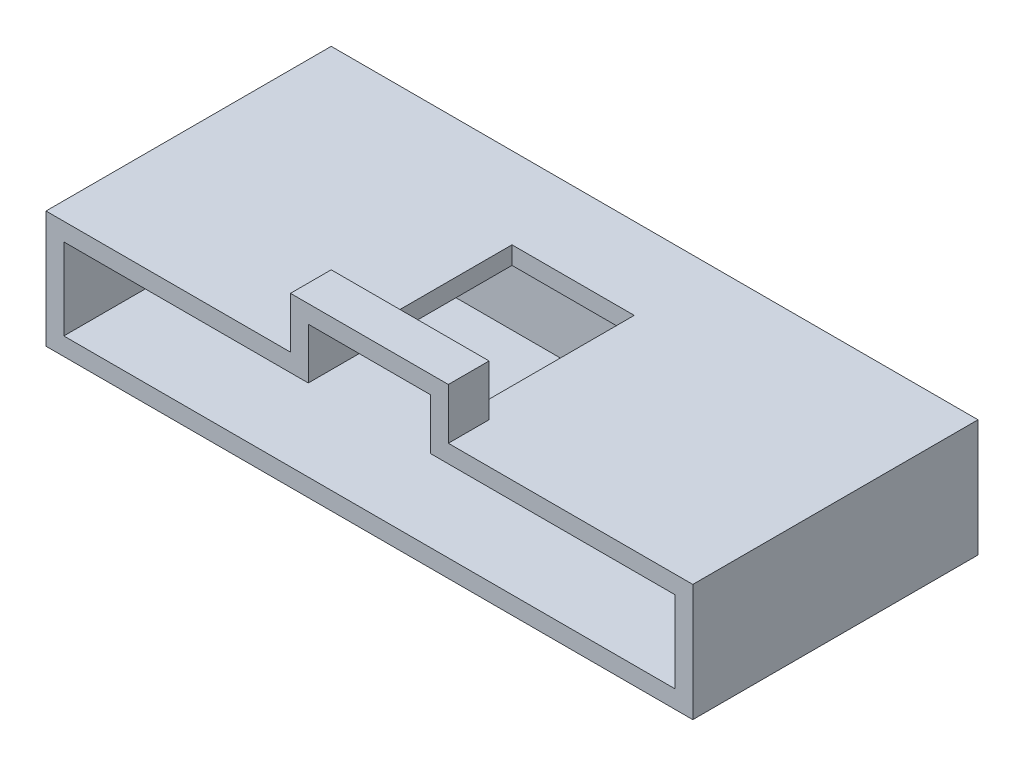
ISO-10303-21;
HEADER;
FILE_DESCRIPTION(('STEP AP214'),'2;1');
FILE_NAME('part.step','',(''),(''),'','','');
FILE_SCHEMA(('AUTOMOTIVE_DESIGN { 1 0 10303 214 1 1 1 1 }'));
ENDSEC;
DATA;
#1=APPLICATION_CONTEXT('core data for automotive mechanical design processes');
#2=APPLICATION_PROTOCOL_DEFINITION('international standard','automotive_design',2000,#1);
#3=PRODUCT_CONTEXT('',#1,'mechanical');
#4=PRODUCT('Part','Part','',(#3));
#5=PRODUCT_RELATED_PRODUCT_CATEGORY('part','',(#4));
#6=PRODUCT_DEFINITION_FORMATION('','',#4);
#7=PRODUCT_DEFINITION_CONTEXT('part definition',#1,'design');
#8=PRODUCT_DEFINITION('design','',#6,#7);
#9=PRODUCT_DEFINITION_SHAPE('','',#8);
#10=(LENGTH_UNIT() NAMED_UNIT(*) SI_UNIT(.MILLI.,.METRE.));
#11=(NAMED_UNIT(*) PLANE_ANGLE_UNIT() SI_UNIT($,.RADIAN.));
#12=(NAMED_UNIT(*) SI_UNIT($,.STERADIAN.) SOLID_ANGLE_UNIT());
#13=UNCERTAINTY_MEASURE_WITH_UNIT(LENGTH_MEASURE(1.E-05),#10,'distance_accuracy_value','');
#14=(GEOMETRIC_REPRESENTATION_CONTEXT(3) GLOBAL_UNCERTAINTY_ASSIGNED_CONTEXT((#13)) GLOBAL_UNIT_ASSIGNED_CONTEXT((#10,
#11,#12)) REPRESENTATION_CONTEXT('',''));
#15=CARTESIAN_POINT('',(0.,0.,0.));
#16=DIRECTION('',(0.,0.,1.));
#17=DIRECTION('',(1.,0.,0.));
#18=AXIS2_PLACEMENT_3D('',#15,#16,#17);
#19=CARTESIAN_POINT('',(0.,0.,11.2));
#20=DIRECTION('',(1.,0.,0.));
#21=DIRECTION('',(0.,0.,-1.));
#22=AXIS2_PLACEMENT_3D('',#19,#20,#21);
#23=PLANE('',#22);
#24=DIRECTION('',(0.,-1.,0.));
#25=VECTOR('',#24,1.);
#26=CARTESIAN_POINT('',(0.,0.,0.));
#27=LINE('',#26,#25);
#28=CARTESIAN_POINT('',(0.,4.6,0.));
#29=VERTEX_POINT('',#28);
#30=CARTESIAN_POINT('',(0.,0.,0.));
#31=VERTEX_POINT('',#30);
#32=EDGE_CURVE('E244',#29,#31,#27,.T.);
#33=ORIENTED_EDGE('',*,*,#32,.T.);
#34=DIRECTION('',(0.,0.,-1.));
#35=VECTOR('',#34,1.);
#36=CARTESIAN_POINT('',(0.,0.,11.2));
#37=LINE('',#36,#35);
#38=CARTESIAN_POINT('',(0.,0.,11.2));
#39=VERTEX_POINT('',#38);
#40=EDGE_CURVE('E279',#39,#31,#37,.T.);
#41=ORIENTED_EDGE('',*,*,#40,.F.);
#42=DIRECTION('',(0.,-1.,0.));
#43=VECTOR('',#42,1.);
#44=CARTESIAN_POINT('',(0.,0.,11.2));
#45=LINE('',#44,#43);
#46=CARTESIAN_POINT('',(0.,4.6,11.2));
#47=VERTEX_POINT('',#46);
#48=EDGE_CURVE('E251',#47,#39,#45,.T.);
#49=ORIENTED_EDGE('',*,*,#48,.F.);
#50=DIRECTION('',(0.,0.,-1.));
#51=VECTOR('',#50,1.);
#52=CARTESIAN_POINT('',(0.,4.6,11.2));
#53=LINE('',#52,#51);
#54=EDGE_CURVE('E263',#47,#29,#53,.T.);
#55=ORIENTED_EDGE('',*,*,#54,.T.);
#56=EDGE_LOOP('',(#33,#41,#49,#55));
#57=FACE_BOUND('',#56,.T.);
#58=ADVANCED_FACE('F33',(#57),#23,.F.);
#59=CARTESIAN_POINT('',(0.,0.,11.2));
#60=DIRECTION('',(0.,1.,0.));
#61=DIRECTION('',(0.,0.,1.));
#62=AXIS2_PLACEMENT_3D('',#59,#60,#61);
#63=PLANE('',#62);
#64=DIRECTION('',(1.,0.,0.));
#65=VECTOR('',#64,1.);
#66=CARTESIAN_POINT('',(0.,0.,0.));
#67=LINE('',#66,#65);
#68=CARTESIAN_POINT('',(25.4,0.,0.));
#69=VERTEX_POINT('',#68);
#70=EDGE_CURVE('E266',#31,#69,#67,.T.);
#71=ORIENTED_EDGE('',*,*,#70,.T.);
#72=DIRECTION('',(0.,0.,-1.));
#73=VECTOR('',#72,1.);
#74=CARTESIAN_POINT('',(25.4,0.,11.2));
#75=LINE('',#74,#73);
#76=CARTESIAN_POINT('',(25.4,0.,11.2));
#77=VERTEX_POINT('',#76);
#78=EDGE_CURVE('E276',#77,#69,#75,.T.);
#79=ORIENTED_EDGE('',*,*,#78,.F.);
#80=DIRECTION('',(1.,0.,0.));
#81=VECTOR('',#80,1.);
#82=CARTESIAN_POINT('',(0.,0.,11.2));
#83=LINE('',#82,#81);
#84=EDGE_CURVE('E254',#39,#77,#83,.T.);
#85=ORIENTED_EDGE('',*,*,#84,.F.);
#86=ORIENTED_EDGE('',*,*,#40,.T.);
#87=EDGE_LOOP('',(#71,#79,#85,#86));
#88=FACE_BOUND('',#87,.T.);
#89=ADVANCED_FACE('F336',(#88),#63,.F.);
#90=CARTESIAN_POINT('',(25.4,0.,11.2));
#91=DIRECTION('',(-1.,0.,0.));
#92=DIRECTION('',(0.,0.,1.));
#93=AXIS2_PLACEMENT_3D('',#90,#91,#92);
#94=PLANE('',#93);
#95=DIRECTION('',(0.,1.,0.));
#96=VECTOR('',#95,1.);
#97=CARTESIAN_POINT('',(25.4,0.,0.));
#98=LINE('',#97,#96);
#99=CARTESIAN_POINT('',(25.4,4.6,0.));
#100=VERTEX_POINT('',#99);
#101=EDGE_CURVE('E268',#69,#100,#98,.T.);
#102=ORIENTED_EDGE('',*,*,#101,.T.);
#103=DIRECTION('',(0.,0.,-1.));
#104=VECTOR('',#103,1.);
#105=CARTESIAN_POINT('',(25.4,4.6,11.2));
#106=LINE('',#105,#104);
#107=CARTESIAN_POINT('',(25.4,4.6,11.2));
#108=VERTEX_POINT('',#107);
#109=EDGE_CURVE('E273',#108,#100,#106,.T.);
#110=ORIENTED_EDGE('',*,*,#109,.F.);
#111=DIRECTION('',(0.,1.,0.));
#112=VECTOR('',#111,1.);
#113=CARTESIAN_POINT('',(25.4,0.,11.2));
#114=LINE('',#113,#112);
#115=EDGE_CURVE('E257',#77,#108,#114,.T.);
#116=ORIENTED_EDGE('',*,*,#115,.F.);
#117=ORIENTED_EDGE('',*,*,#78,.T.);
#118=EDGE_LOOP('',(#102,#110,#116,#117));
#119=FACE_BOUND('',#118,.T.);
#120=ADVANCED_FACE('F341',(#119),#94,.F.);
#121=CARTESIAN_POINT('',(0.,4.6,11.2));
#122=DIRECTION('',(0.,-1.,0.));
#123=DIRECTION('',(0.,0.,-1.));
#124=AXIS2_PLACEMENT_3D('',#121,#122,#123);
#125=PLANE('',#124);
#126=DIRECTION('',(1.,0.,0.));
#127=VECTOR('',#126,1.);
#128=CARTESIAN_POINT('',(0.,4.6,9.6));
#129=LINE('',#128,#127);
#130=CARTESIAN_POINT('',(9.6,4.6,9.6));
#131=VERTEX_POINT('',#130);
#132=CARTESIAN_POINT('',(10.3,4.6,9.6));
#133=VERTEX_POINT('',#132);
#134=EDGE_CURVE('E209',#131,#133,#129,.T.);
#135=ORIENTED_EDGE('',*,*,#134,.T.);
#136=DIRECTION('',(0.,0.,-1.));
#137=VECTOR('',#136,1.);
#138=CARTESIAN_POINT('',(10.3,4.6,11.2));
#139=LINE('',#138,#137);
#140=CARTESIAN_POINT('',(10.3,4.6,3.2));
#141=VERTEX_POINT('',#140);
#142=EDGE_CURVE('E183',#133,#141,#139,.T.);
#143=ORIENTED_EDGE('',*,*,#142,.T.);
#144=DIRECTION('',(-1.,0.,0.));
#145=VECTOR('',#144,1.);
#146=CARTESIAN_POINT('',(0.,4.6,3.2));
#147=LINE('',#146,#145);
#148=CARTESIAN_POINT('',(15.1,4.6,3.2));
#149=VERTEX_POINT('',#148);
#150=EDGE_CURVE('E186',#149,#141,#147,.T.);
#151=ORIENTED_EDGE('',*,*,#150,.F.);
#152=DIRECTION('',(0.,0.,1.));
#153=VECTOR('',#152,1.);
#154=CARTESIAN_POINT('',(15.1,4.6,11.2));
#155=LINE('',#154,#153);
#156=CARTESIAN_POINT('',(15.1,4.6,9.6));
#157=VERTEX_POINT('',#156);
#158=EDGE_CURVE('E162',#149,#157,#155,.T.);
#159=ORIENTED_EDGE('',*,*,#158,.T.);
#160=CARTESIAN_POINT('',(15.8,4.6,9.6));
#161=VERTEX_POINT('',#160);
#162=EDGE_CURVE('E206',#157,#161,#129,.T.);
#163=ORIENTED_EDGE('',*,*,#162,.T.);
#164=DIRECTION('',(0.,0.,1.));
#165=VECTOR('',#164,1.);
#166=CARTESIAN_POINT('',(15.8,4.6,11.2));
#167=LINE('',#166,#165);
#168=CARTESIAN_POINT('',(15.8,4.6,11.2));
#169=VERTEX_POINT('',#168);
#170=EDGE_CURVE('E212',#161,#169,#167,.T.);
#171=ORIENTED_EDGE('',*,*,#170,.T.);
#172=DIRECTION('',(-1.,0.,0.));
#173=VECTOR('',#172,1.);
#174=CARTESIAN_POINT('',(0.,4.6,11.2));
#175=LINE('',#174,#173);
#176=EDGE_CURVE('E260',#108,#169,#175,.T.);
#177=ORIENTED_EDGE('',*,*,#176,.F.);
#178=ORIENTED_EDGE('',*,*,#109,.T.);
#179=DIRECTION('',(-1.,0.,0.));
#180=VECTOR('',#179,1.);
#181=CARTESIAN_POINT('',(0.,4.6,0.));
#182=LINE('',#181,#180);
#183=EDGE_CURVE('E255',#100,#29,#182,.T.);
#184=ORIENTED_EDGE('',*,*,#183,.T.);
#185=ORIENTED_EDGE('',*,*,#54,.F.);
#186=CARTESIAN_POINT('',(9.6,4.6,11.2));
#187=VERTEX_POINT('',#186);
#188=EDGE_CURVE('E259',#187,#47,#175,.T.);
#189=ORIENTED_EDGE('',*,*,#188,.F.);
#190=DIRECTION('',(0.,0.,-1.));
#191=VECTOR('',#190,1.);
#192=CARTESIAN_POINT('',(9.6,4.6,11.2));
#193=LINE('',#192,#191);
#194=EDGE_CURVE('E215',#187,#131,#193,.T.);
#195=ORIENTED_EDGE('',*,*,#194,.T.);
#196=EDGE_LOOP('',(#135,#143,#151,#159,#163,#171,#177,#178,#184,#185,#189,#195));
#197=FACE_BOUND('',#196,.T.);
#198=ADVANCED_FACE('F295',(#197),#125,.F.);
#199=CARTESIAN_POINT('',(0.,0.,11.2));
#200=DIRECTION('',(0.,0.,-1.));
#201=DIRECTION('',(-1.,0.,0.));
#202=AXIS2_PLACEMENT_3D('',#199,#200,#201);
#203=PLANE('',#202);
#204=ORIENTED_EDGE('',*,*,#176,.T.);
#205=DIRECTION('',(0.,1.,0.));
#206=VECTOR('',#205,1.);
#207=CARTESIAN_POINT('',(15.8,3.9,11.2));
#208=LINE('',#207,#206);
#209=CARTESIAN_POINT('',(15.8,6.6,11.2));
#210=VERTEX_POINT('',#209);
#211=EDGE_CURVE('E200',#169,#210,#208,.T.);
#212=ORIENTED_EDGE('',*,*,#211,.T.);
#213=DIRECTION('',(-1.,0.,0.));
#214=VECTOR('',#213,1.);
#215=CARTESIAN_POINT('',(9.6,6.6,11.2));
#216=LINE('',#215,#214);
#217=CARTESIAN_POINT('',(9.6,6.6,11.2));
#218=VERTEX_POINT('',#217);
#219=EDGE_CURVE('E193',#210,#218,#216,.T.);
#220=ORIENTED_EDGE('',*,*,#219,.T.);
#221=DIRECTION('',(0.,-1.,0.));
#222=VECTOR('',#221,1.);
#223=CARTESIAN_POINT('',(9.6,3.9,11.2));
#224=LINE('',#223,#222);
#225=EDGE_CURVE('E188',#218,#187,#224,.T.);
#226=ORIENTED_EDGE('',*,*,#225,.T.);
#227=ORIENTED_EDGE('',*,*,#188,.T.);
#228=ORIENTED_EDGE('',*,*,#48,.T.);
#229=ORIENTED_EDGE('',*,*,#84,.T.);
#230=ORIENTED_EDGE('',*,*,#115,.T.);
#231=EDGE_LOOP('',(#204,#212,#220,#226,#227,#228,#229,#230));
#232=FACE_BOUND('',#231,.T.);
#233=DIRECTION('',(-1.,0.,0.));
#234=VECTOR('',#233,1.);
#235=CARTESIAN_POINT('',(0.7,3.9,11.2));
#236=LINE('',#235,#234);
#237=CARTESIAN_POINT('',(10.3,3.9,11.2));
#238=VERTEX_POINT('',#237);
#239=CARTESIAN_POINT('',(0.7,3.9,11.2));
#240=VERTEX_POINT('',#239);
#241=EDGE_CURVE('E239',#238,#240,#236,.T.);
#242=ORIENTED_EDGE('',*,*,#241,.F.);
#243=DIRECTION('',(0.,-1.,0.));
#244=VECTOR('',#243,1.);
#245=CARTESIAN_POINT('',(10.3,5.9,11.2));
#246=LINE('',#245,#244);
#247=CARTESIAN_POINT('',(10.3,5.9,11.2));
#248=VERTEX_POINT('',#247);
#249=EDGE_CURVE('E303',#248,#238,#246,.T.);
#250=ORIENTED_EDGE('',*,*,#249,.F.);
#251=DIRECTION('',(-1.,0.,0.));
#252=VECTOR('',#251,1.);
#253=CARTESIAN_POINT('',(10.3,5.9,11.2));
#254=LINE('',#253,#252);
#255=CARTESIAN_POINT('',(15.1,5.9,11.2));
#256=VERTEX_POINT('',#255);
#257=EDGE_CURVE('E298',#256,#248,#254,.T.);
#258=ORIENTED_EDGE('',*,*,#257,.F.);
#259=DIRECTION('',(0.,1.,0.));
#260=VECTOR('',#259,1.);
#261=CARTESIAN_POINT('',(15.1,5.9,11.2));
#262=LINE('',#261,#260);
#263=CARTESIAN_POINT('',(15.1,3.9,11.2));
#264=VERTEX_POINT('',#263);
#265=EDGE_CURVE('E300',#264,#256,#262,.T.);
#266=ORIENTED_EDGE('',*,*,#265,.F.);
#267=CARTESIAN_POINT('',(24.7,3.9,11.2));
#268=VERTEX_POINT('',#267);
#269=EDGE_CURVE('E175',#268,#264,#236,.T.);
#270=ORIENTED_EDGE('',*,*,#269,.F.);
#271=DIRECTION('',(0.,1.,0.));
#272=VECTOR('',#271,1.);
#273=CARTESIAN_POINT('',(24.7,3.9,11.2));
#274=LINE('',#273,#272);
#275=CARTESIAN_POINT('',(24.7,0.7,11.2));
#276=VERTEX_POINT('',#275);
#277=EDGE_CURVE('E236',#276,#268,#274,.T.);
#278=ORIENTED_EDGE('',*,*,#277,.F.);
#279=DIRECTION('',(1.,0.,0.));
#280=VECTOR('',#279,1.);
#281=CARTESIAN_POINT('',(0.7,0.7,11.2));
#282=LINE('',#281,#280);
#283=CARTESIAN_POINT('',(0.7,0.7,11.2));
#284=VERTEX_POINT('',#283);
#285=EDGE_CURVE('E233',#284,#276,#282,.T.);
#286=ORIENTED_EDGE('',*,*,#285,.F.);
#287=DIRECTION('',(0.,-1.,0.));
#288=VECTOR('',#287,1.);
#289=CARTESIAN_POINT('',(0.7,3.9,11.2));
#290=LINE('',#289,#288);
#291=EDGE_CURVE('E218',#240,#284,#290,.T.);
#292=ORIENTED_EDGE('',*,*,#291,.F.);
#293=EDGE_LOOP('',(#242,#250,#258,#266,#270,#278,#286,#292));
#294=FACE_BOUND('',#293,.T.);
#295=ADVANCED_FACE('F309',(#232,#294),#203,.F.);
#296=CARTESIAN_POINT('',(0.,0.,0.));
#297=DIRECTION('',(0.,0.,-1.));
#298=DIRECTION('',(-1.,0.,0.));
#299=AXIS2_PLACEMENT_3D('',#296,#297,#298);
#300=PLANE('',#299);
#301=ORIENTED_EDGE('',*,*,#32,.F.);
#302=ORIENTED_EDGE('',*,*,#183,.F.);
#303=ORIENTED_EDGE('',*,*,#101,.F.);
#304=ORIENTED_EDGE('',*,*,#70,.F.);
#305=EDGE_LOOP('',(#301,#302,#303,#304));
#306=FACE_BOUND('',#305,.T.);
#307=ADVANCED_FACE('F349',(#306),#300,.T.);
#308=CARTESIAN_POINT('',(0.7,3.9,2.2));
#309=DIRECTION('',(-1.,0.,0.));
#310=DIRECTION('',(0.,-1.,0.));
#311=AXIS2_PLACEMENT_3D('',#308,#309,#310);
#312=PLANE('',#311);
#313=ORIENTED_EDGE('',*,*,#291,.T.);
#314=DIRECTION('',(0.,0.,1.));
#315=VECTOR('',#314,1.);
#316=CARTESIAN_POINT('',(0.7,0.7,2.2));
#317=LINE('',#316,#315);
#318=CARTESIAN_POINT('',(0.7,0.7,2.2));
#319=VERTEX_POINT('',#318);
#320=EDGE_CURVE('E231',#319,#284,#317,.T.);
#321=ORIENTED_EDGE('',*,*,#320,.F.);
#322=DIRECTION('',(0.,-1.,0.));
#323=VECTOR('',#322,1.);
#324=CARTESIAN_POINT('',(0.7,3.9,2.2));
#325=LINE('',#324,#323);
#326=CARTESIAN_POINT('',(0.7,3.9,2.2));
#327=VERTEX_POINT('',#326);
#328=EDGE_CURVE('E219',#327,#319,#325,.T.);
#329=ORIENTED_EDGE('',*,*,#328,.F.);
#330=DIRECTION('',(0.,0.,1.));
#331=VECTOR('',#330,1.);
#332=CARTESIAN_POINT('',(0.7,3.9,2.2));
#333=LINE('',#332,#331);
#334=EDGE_CURVE('E241',#327,#240,#333,.T.);
#335=ORIENTED_EDGE('',*,*,#334,.T.);
#336=EDGE_LOOP('',(#313,#321,#329,#335));
#337=FACE_BOUND('',#336,.T.);
#338=ADVANCED_FACE('F315',(#337),#312,.F.);
#339=CARTESIAN_POINT('',(0.7,3.9,2.2));
#340=DIRECTION('',(0.,1.,0.));
#341=DIRECTION('',(0.,0.,1.));
#342=AXIS2_PLACEMENT_3D('',#339,#340,#341);
#343=PLANE('',#342);
#344=DIRECTION('',(1.,0.,0.));
#345=VECTOR('',#344,1.);
#346=CARTESIAN_POINT('',(10.3,3.9,3.2));
#347=LINE('',#346,#345);
#348=CARTESIAN_POINT('',(10.3,3.9,3.2));
#349=VERTEX_POINT('',#348);
#350=CARTESIAN_POINT('',(15.1,3.9,3.2));
#351=VERTEX_POINT('',#350);
#352=EDGE_CURVE('E165',#349,#351,#347,.T.);
#353=ORIENTED_EDGE('',*,*,#352,.F.);
#354=DIRECTION('',(0.,0.,1.));
#355=VECTOR('',#354,1.);
#356=CARTESIAN_POINT('',(10.3,3.9,3.2));
#357=LINE('',#356,#355);
#358=EDGE_CURVE('E47',#349,#238,#357,.T.);
#359=ORIENTED_EDGE('',*,*,#358,.T.);
#360=ORIENTED_EDGE('',*,*,#241,.T.);
#361=ORIENTED_EDGE('',*,*,#334,.F.);
#362=DIRECTION('',(-1.,0.,0.));
#363=VECTOR('',#362,1.);
#364=CARTESIAN_POINT('',(0.7,3.9,2.2));
#365=LINE('',#364,#363);
#366=CARTESIAN_POINT('',(24.7,3.9,2.2));
#367=VERTEX_POINT('',#366);
#368=EDGE_CURVE('E228',#367,#327,#365,.T.);
#369=ORIENTED_EDGE('',*,*,#368,.F.);
#370=DIRECTION('',(0.,0.,1.));
#371=VECTOR('',#370,1.);
#372=CARTESIAN_POINT('',(24.7,3.9,2.2));
#373=LINE('',#372,#371);
#374=EDGE_CURVE('E245',#367,#268,#373,.T.);
#375=ORIENTED_EDGE('',*,*,#374,.T.);
#376=ORIENTED_EDGE('',*,*,#269,.T.);
#377=DIRECTION('',(0.,0.,1.));
#378=VECTOR('',#377,1.);
#379=CARTESIAN_POINT('',(15.1,3.9,3.2));
#380=LINE('',#379,#378);
#381=EDGE_CURVE('E159',#351,#264,#380,.T.);
#382=ORIENTED_EDGE('',*,*,#381,.F.);
#383=EDGE_LOOP('',(#353,#359,#360,#361,#369,#375,#376,#382));
#384=FACE_BOUND('',#383,.T.);
#385=ADVANCED_FACE('F173',(#384),#343,.F.);
#386=CARTESIAN_POINT('',(24.7,3.9,2.2));
#387=DIRECTION('',(1.,0.,0.));
#388=DIRECTION('',(0.,0.,-1.));
#389=AXIS2_PLACEMENT_3D('',#386,#387,#388);
#390=PLANE('',#389);
#391=ORIENTED_EDGE('',*,*,#277,.T.);
#392=ORIENTED_EDGE('',*,*,#374,.F.);
#393=DIRECTION('',(0.,1.,0.));
#394=VECTOR('',#393,1.);
#395=CARTESIAN_POINT('',(24.7,3.9,2.2));
#396=LINE('',#395,#394);
#397=CARTESIAN_POINT('',(24.7,0.7,2.2));
#398=VERTEX_POINT('',#397);
#399=EDGE_CURVE('E225',#398,#367,#396,.T.);
#400=ORIENTED_EDGE('',*,*,#399,.F.);
#401=DIRECTION('',(0.,0.,1.));
#402=VECTOR('',#401,1.);
#403=CARTESIAN_POINT('',(24.7,0.7,2.2));
#404=LINE('',#403,#402);
#405=EDGE_CURVE('E247',#398,#276,#404,.T.);
#406=ORIENTED_EDGE('',*,*,#405,.T.);
#407=EDGE_LOOP('',(#391,#392,#400,#406));
#408=FACE_BOUND('',#407,.T.);
#409=ADVANCED_FACE('F322',(#408),#390,.F.);
#410=CARTESIAN_POINT('',(0.7,0.7,2.2));
#411=DIRECTION('',(0.,-1.,0.));
#412=DIRECTION('',(0.,0.,-1.));
#413=AXIS2_PLACEMENT_3D('',#410,#411,#412);
#414=PLANE('',#413);
#415=ORIENTED_EDGE('',*,*,#285,.T.);
#416=ORIENTED_EDGE('',*,*,#405,.F.);
#417=DIRECTION('',(1.,0.,0.));
#418=VECTOR('',#417,1.);
#419=CARTESIAN_POINT('',(0.7,0.7,2.2));
#420=LINE('',#419,#418);
#421=EDGE_CURVE('E222',#319,#398,#420,.T.);
#422=ORIENTED_EDGE('',*,*,#421,.F.);
#423=ORIENTED_EDGE('',*,*,#320,.T.);
#424=EDGE_LOOP('',(#415,#416,#422,#423));
#425=FACE_BOUND('',#424,.T.);
#426=ADVANCED_FACE('F324',(#425),#414,.F.);
#427=CARTESIAN_POINT('',(0.,0.,2.2));
#428=DIRECTION('',(0.,0.,1.));
#429=DIRECTION('',(1.,0.,0.));
#430=AXIS2_PLACEMENT_3D('',#427,#428,#429);
#431=PLANE('',#430);
#432=ORIENTED_EDGE('',*,*,#328,.T.);
#433=ORIENTED_EDGE('',*,*,#421,.T.);
#434=ORIENTED_EDGE('',*,*,#399,.T.);
#435=ORIENTED_EDGE('',*,*,#368,.T.);
#436=EDGE_LOOP('',(#432,#433,#434,#435));
#437=FACE_BOUND('',#436,.T.);
#438=ADVANCED_FACE('F318',(#437),#431,.T.);
#439=CARTESIAN_POINT('',(9.6,3.9,9.6));
#440=DIRECTION('',(-1.,0.,0.));
#441=DIRECTION('',(0.,0.,1.));
#442=AXIS2_PLACEMENT_3D('',#439,#440,#441);
#443=PLANE('',#442);
#444=ORIENTED_EDGE('',*,*,#194,.F.);
#445=ORIENTED_EDGE('',*,*,#225,.F.);
#446=DIRECTION('',(0.,0.,1.));
#447=VECTOR('',#446,1.);
#448=CARTESIAN_POINT('',(9.6,6.6,9.6));
#449=LINE('',#448,#447);
#450=CARTESIAN_POINT('',(9.6,6.6,9.6));
#451=VERTEX_POINT('',#450);
#452=EDGE_CURVE('E204',#451,#218,#449,.T.);
#453=ORIENTED_EDGE('',*,*,#452,.F.);
#454=DIRECTION('',(0.,-1.,0.));
#455=VECTOR('',#454,1.);
#456=CARTESIAN_POINT('',(9.6,3.9,9.6));
#457=LINE('',#456,#455);
#458=EDGE_CURVE('E189',#451,#131,#457,.T.);
#459=ORIENTED_EDGE('',*,*,#458,.T.);
#460=EDGE_LOOP('',(#444,#445,#453,#459));
#461=FACE_BOUND('',#460,.T.);
#462=ADVANCED_FACE('F331',(#461),#443,.T.);
#463=CARTESIAN_POINT('',(15.8,3.9,9.6));
#464=DIRECTION('',(1.,0.,0.));
#465=DIRECTION('',(0.,0.,-1.));
#466=AXIS2_PLACEMENT_3D('',#463,#464,#465);
#467=PLANE('',#466);
#468=ORIENTED_EDGE('',*,*,#170,.F.);
#469=DIRECTION('',(0.,1.,0.));
#470=VECTOR('',#469,1.);
#471=CARTESIAN_POINT('',(15.8,3.9,9.6));
#472=LINE('',#471,#470);
#473=CARTESIAN_POINT('',(15.8,6.6,9.6));
#474=VERTEX_POINT('',#473);
#475=EDGE_CURVE('E192',#161,#474,#472,.T.);
#476=ORIENTED_EDGE('',*,*,#475,.T.);
#477=DIRECTION('',(0.,0.,1.));
#478=VECTOR('',#477,1.);
#479=CARTESIAN_POINT('',(15.8,6.6,9.6));
#480=LINE('',#479,#478);
#481=EDGE_CURVE('E198',#474,#210,#480,.T.);
#482=ORIENTED_EDGE('',*,*,#481,.T.);
#483=ORIENTED_EDGE('',*,*,#211,.F.);
#484=EDGE_LOOP('',(#468,#476,#482,#483));
#485=FACE_BOUND('',#484,.T.);
#486=ADVANCED_FACE('F363',(#485),#467,.T.);
#487=CARTESIAN_POINT('',(0.,0.,9.6));
#488=DIRECTION('',(0.,0.,-1.));
#489=DIRECTION('',(-1.,0.,0.));
#490=AXIS2_PLACEMENT_3D('',#487,#488,#489);
#491=PLANE('',#490);
#492=DIRECTION('',(0.,1.,0.));
#493=VECTOR('',#492,1.);
#494=CARTESIAN_POINT('',(10.3,0.,9.6));
#495=LINE('',#494,#493);
#496=CARTESIAN_POINT('',(10.3,5.9,9.6));
#497=VERTEX_POINT('',#496);
#498=EDGE_CURVE('E11',#133,#497,#495,.T.);
#499=ORIENTED_EDGE('',*,*,#498,.F.);
#500=ORIENTED_EDGE('',*,*,#134,.F.);
#501=ORIENTED_EDGE('',*,*,#458,.F.);
#502=DIRECTION('',(-1.,0.,0.));
#503=VECTOR('',#502,1.);
#504=CARTESIAN_POINT('',(9.6,6.6,9.6));
#505=LINE('',#504,#503);
#506=EDGE_CURVE('E195',#474,#451,#505,.T.);
#507=ORIENTED_EDGE('',*,*,#506,.F.);
#508=ORIENTED_EDGE('',*,*,#475,.F.);
#509=ORIENTED_EDGE('',*,*,#162,.F.);
#510=DIRECTION('',(0.,-1.,0.));
#511=VECTOR('',#510,1.);
#512=CARTESIAN_POINT('',(15.1,0.,9.6));
#513=LINE('',#512,#511);
#514=CARTESIAN_POINT('',(15.1,5.9,9.6));
#515=VERTEX_POINT('',#514);
#516=EDGE_CURVE('E282',#515,#157,#513,.T.);
#517=ORIENTED_EDGE('',*,*,#516,.F.);
#518=DIRECTION('',(1.,0.,0.));
#519=VECTOR('',#518,1.);
#520=CARTESIAN_POINT('',(0.,5.9,9.6));
#521=LINE('',#520,#519);
#522=EDGE_CURVE('E40',#497,#515,#521,.T.);
#523=ORIENTED_EDGE('',*,*,#522,.F.);
#524=EDGE_LOOP('',(#499,#500,#501,#507,#508,#509,#517,#523));
#525=FACE_BOUND('',#524,.T.);
#526=ADVANCED_FACE('F292',(#525),#491,.T.);
#527=CARTESIAN_POINT('',(9.6,6.6,9.6));
#528=DIRECTION('',(0.,1.,0.));
#529=DIRECTION('',(0.,0.,1.));
#530=AXIS2_PLACEMENT_3D('',#527,#528,#529);
#531=PLANE('',#530);
#532=ORIENTED_EDGE('',*,*,#219,.F.);
#533=ORIENTED_EDGE('',*,*,#481,.F.);
#534=ORIENTED_EDGE('',*,*,#506,.T.);
#535=ORIENTED_EDGE('',*,*,#452,.T.);
#536=EDGE_LOOP('',(#532,#533,#534,#535));
#537=FACE_BOUND('',#536,.T.);
#538=ADVANCED_FACE('F366',(#537),#531,.T.);
#539=CARTESIAN_POINT('',(0.,0.,3.2));
#540=DIRECTION('',(0.,0.,1.));
#541=DIRECTION('',(1.,0.,0.));
#542=AXIS2_PLACEMENT_3D('',#539,#540,#541);
#543=PLANE('',#542);
#544=ORIENTED_EDGE('',*,*,#150,.T.);
#545=DIRECTION('',(0.,-1.,0.));
#546=VECTOR('',#545,1.);
#547=CARTESIAN_POINT('',(10.3,5.9,3.2));
#548=LINE('',#547,#546);
#549=EDGE_CURVE('E169',#141,#349,#548,.T.);
#550=ORIENTED_EDGE('',*,*,#549,.T.);
#551=ORIENTED_EDGE('',*,*,#352,.T.);
#552=DIRECTION('',(0.,1.,0.));
#553=VECTOR('',#552,1.);
#554=CARTESIAN_POINT('',(15.1,5.9,3.2));
#555=LINE('',#554,#553);
#556=EDGE_CURVE('E155',#351,#149,#555,.T.);
#557=ORIENTED_EDGE('',*,*,#556,.T.);
#558=EDGE_LOOP('',(#544,#550,#551,#557));
#559=FACE_BOUND('',#558,.T.);
#560=ADVANCED_FACE('F168',(#559),#543,.T.);
#561=CARTESIAN_POINT('',(10.3,5.9,3.2));
#562=DIRECTION('',(-1.,0.,0.));
#563=DIRECTION('',(0.,0.,1.));
#564=AXIS2_PLACEMENT_3D('',#561,#562,#563);
#565=PLANE('',#564);
#566=ORIENTED_EDGE('',*,*,#498,.T.);
#567=DIRECTION('',(0.,0.,1.));
#568=VECTOR('',#567,1.);
#569=CARTESIAN_POINT('',(10.3,5.9,3.2));
#570=LINE('',#569,#568);
#571=EDGE_CURVE('E177',#497,#248,#570,.T.);
#572=ORIENTED_EDGE('',*,*,#571,.T.);
#573=ORIENTED_EDGE('',*,*,#249,.T.);
#574=ORIENTED_EDGE('',*,*,#358,.F.);
#575=ORIENTED_EDGE('',*,*,#549,.F.);
#576=ORIENTED_EDGE('',*,*,#142,.F.);
#577=EDGE_LOOP('',(#566,#572,#573,#574,#575,#576));
#578=FACE_BOUND('',#577,.T.);
#579=ADVANCED_FACE('F297',(#578),#565,.F.);
#580=CARTESIAN_POINT('',(15.1,5.9,3.2));
#581=DIRECTION('',(1.,0.,0.));
#582=DIRECTION('',(0.,0.,-1.));
#583=AXIS2_PLACEMENT_3D('',#580,#581,#582);
#584=PLANE('',#583);
#585=ORIENTED_EDGE('',*,*,#556,.F.);
#586=ORIENTED_EDGE('',*,*,#381,.T.);
#587=ORIENTED_EDGE('',*,*,#265,.T.);
#588=DIRECTION('',(0.,0.,1.));
#589=VECTOR('',#588,1.);
#590=CARTESIAN_POINT('',(15.1,5.9,3.2));
#591=LINE('',#590,#589);
#592=EDGE_CURVE('E55',#515,#256,#591,.T.);
#593=ORIENTED_EDGE('',*,*,#592,.F.);
#594=ORIENTED_EDGE('',*,*,#516,.T.);
#595=ORIENTED_EDGE('',*,*,#158,.F.);
#596=EDGE_LOOP('',(#585,#586,#587,#593,#594,#595));
#597=FACE_BOUND('',#596,.T.);
#598=ADVANCED_FACE('F157',(#597),#584,.F.);
#599=CARTESIAN_POINT('',(10.3,5.9,3.2));
#600=DIRECTION('',(0.,1.,0.));
#601=DIRECTION('',(0.,0.,1.));
#602=AXIS2_PLACEMENT_3D('',#599,#600,#601);
#603=PLANE('',#602);
#604=ORIENTED_EDGE('',*,*,#522,.T.);
#605=ORIENTED_EDGE('',*,*,#592,.T.);
#606=ORIENTED_EDGE('',*,*,#257,.T.);
#607=ORIENTED_EDGE('',*,*,#571,.F.);
#608=EDGE_LOOP('',(#604,#605,#606,#607));
#609=FACE_BOUND('',#608,.T.);
#610=ADVANCED_FACE('F287',(#609),#603,.F.);
#611=CLOSED_SHELL('',(#58,#89,#120,#198,#295,#307,#338,#385,#409,#426,#438,#462,#486,#526,#538,
#560,#579,#598,#610));
#612=MANIFOLD_SOLID_BREP('B2',#611);
#613=ADVANCED_BREP_SHAPE_REPRESENTATION('',(#18,#612),#14);
#614=SHAPE_DEFINITION_REPRESENTATION(#9,#613);
ENDSEC;
END-ISO-10303-21;
